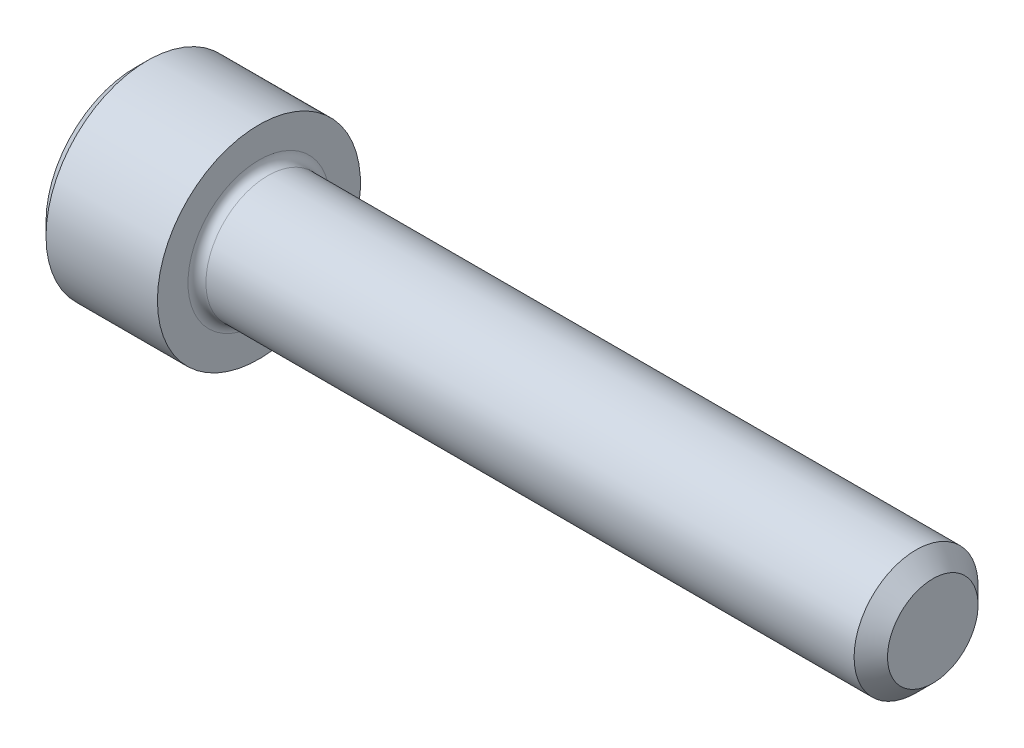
ISO-10303-21;
HEADER;
FILE_DESCRIPTION(('STEP AP214'),'2;1');
FILE_NAME('part.step','',(''),(''),'','','');
FILE_SCHEMA(('AUTOMOTIVE_DESIGN { 1 0 10303 214 1 1 1 1 }'));
ENDSEC;
DATA;
#1=APPLICATION_CONTEXT('core data for automotive mechanical design processes');
#2=APPLICATION_PROTOCOL_DEFINITION('international standard','automotive_design',2000,#1);
#3=PRODUCT_CONTEXT('',#1,'mechanical');
#4=PRODUCT('Part','Part','',(#3));
#5=PRODUCT_RELATED_PRODUCT_CATEGORY('part','',(#4));
#6=PRODUCT_DEFINITION_FORMATION('','',#4);
#7=PRODUCT_DEFINITION_CONTEXT('part definition',#1,'design');
#8=PRODUCT_DEFINITION('design','',#6,#7);
#9=PRODUCT_DEFINITION_SHAPE('','',#8);
#10=(LENGTH_UNIT() NAMED_UNIT(*) SI_UNIT(.MILLI.,.METRE.));
#11=(NAMED_UNIT(*) PLANE_ANGLE_UNIT() SI_UNIT($,.RADIAN.));
#12=(NAMED_UNIT(*) SI_UNIT($,.STERADIAN.) SOLID_ANGLE_UNIT());
#13=UNCERTAINTY_MEASURE_WITH_UNIT(LENGTH_MEASURE(1.E-05),#10,'distance_accuracy_value','');
#14=(GEOMETRIC_REPRESENTATION_CONTEXT(3) GLOBAL_UNCERTAINTY_ASSIGNED_CONTEXT((#13)) GLOBAL_UNIT_ASSIGNED_CONTEXT((#10,
#11,#12)) REPRESENTATION_CONTEXT('',''));
#15=CARTESIAN_POINT('',(0.,0.,0.));
#16=DIRECTION('',(0.,0.,1.));
#17=DIRECTION('',(1.,0.,0.));
#18=AXIS2_PLACEMENT_3D('',#15,#16,#17);
#19=CARTESIAN_POINT('',(0.,0.,0.));
#20=DIRECTION('',(-1.,0.,0.));
#21=DIRECTION('',(0.,0.,0.999999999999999));
#22=AXIS2_PLACEMENT_3D('',#19,#20,#21);
#23=PLANE('',#22);
#24=DIRECTION('',(0.,-0.499999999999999,0.866025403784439));
#25=VECTOR('',#24,1.);
#26=CARTESIAN_POINT('',(0.,1.59845195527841,0.));
#27=LINE('',#26,#25);
#28=CARTESIAN_POINT('',(0.,1.59845195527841,0.));
#29=VERTEX_POINT('',#28);
#30=CARTESIAN_POINT('',(0.,0.799225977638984,1.38430000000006));
#31=VERTEX_POINT('',#30);
#32=EDGE_CURVE('E118',#29,#31,#27,.T.);
#33=ORIENTED_EDGE('',*,*,#32,.T.);
#34=DIRECTION('',(0.,0.999999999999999,0.));
#35=VECTOR('',#34,1.);
#36=CARTESIAN_POINT('',(0.,-0.79922597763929,1.38430000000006));
#37=LINE('',#36,#35);
#38=CARTESIAN_POINT('',(0.,-0.79922597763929,1.38430000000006));
#39=VERTEX_POINT('',#38);
#40=EDGE_CURVE('E107',#39,#31,#37,.T.);
#41=ORIENTED_EDGE('',*,*,#40,.F.);
#42=DIRECTION('',(0.,-0.500000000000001,-0.866025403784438));
#43=VECTOR('',#42,1.);
#44=CARTESIAN_POINT('',(0.,-0.79922597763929,1.38430000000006));
#45=LINE('',#44,#43);
#46=CARTESIAN_POINT('',(0.,-1.59845195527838,0.));
#47=VERTEX_POINT('',#46);
#48=EDGE_CURVE('E117',#39,#47,#45,.T.);
#49=ORIENTED_EDGE('',*,*,#48,.T.);
#50=DIRECTION('',(0.,0.499999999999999,-0.866025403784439));
#51=VECTOR('',#50,1.);
#52=CARTESIAN_POINT('',(0.,-1.59845195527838,0.));
#53=LINE('',#52,#51);
#54=CARTESIAN_POINT('',(0.,-0.799225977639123,-1.38429999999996));
#55=VERTEX_POINT('',#54);
#56=EDGE_CURVE('E136',#47,#55,#53,.T.);
#57=ORIENTED_EDGE('',*,*,#56,.T.);
#58=DIRECTION('',(0.,-1.,0.));
#59=VECTOR('',#58,1.);
#60=CARTESIAN_POINT('',(0.,0.799225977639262,-1.38430000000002));
#61=LINE('',#60,#59);
#62=CARTESIAN_POINT('',(0.,0.799225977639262,-1.38430000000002));
#63=VERTEX_POINT('',#62);
#64=EDGE_CURVE('E139',#63,#55,#61,.T.);
#65=ORIENTED_EDGE('',*,*,#64,.F.);
#66=DIRECTION('',(0.,-0.500000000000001,-0.866025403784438));
#67=VECTOR('',#66,1.);
#68=CARTESIAN_POINT('',(0.,1.59845195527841,0.));
#69=LINE('',#68,#67);
#70=EDGE_CURVE('E132',#29,#63,#69,.T.);
#71=ORIENTED_EDGE('',*,*,#70,.F.);
#72=EDGE_LOOP('',(#33,#41,#49,#57,#65,#71));
#73=FACE_BOUND('',#72,.T.);
#74=CARTESIAN_POINT('',(0.,0.,0.));
#75=DIRECTION('',(-1.,0.,0.));
#76=DIRECTION('',(0.,0.,0.999999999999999));
#77=AXIS2_PLACEMENT_3D('',#74,#75,#76);
#78=CIRCLE('',#77,2.51459999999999);
#79=CARTESIAN_POINT('',(0.,0.,2.51459999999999));
#80=VERTEX_POINT('',#79);
#81=EDGE_CURVE('E190',#80,#80,#78,.T.);
#82=ORIENTED_EDGE('',*,*,#81,.T.);
#83=EDGE_LOOP('',(#82));
#84=FACE_BOUND('',#83,.T.);
#85=ADVANCED_FACE('F36',(#73,#84),#23,.T.);
#86=CARTESIAN_POINT('',(0.,0.,0.));
#87=DIRECTION('',(1.,0.,0.));
#88=DIRECTION('',(0.,0.,-0.999999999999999));
#89=AXIS2_PLACEMENT_3D('',#86,#87,#88);
#90=CONICAL_SURFACE('',#89,2.51459999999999,0.785398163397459);
#91=CARTESIAN_POINT('',(0.355600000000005,0.,0.));
#92=DIRECTION('',(-1.,0.,0.));
#93=DIRECTION('',(0.,0.,0.999999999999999));
#94=AXIS2_PLACEMENT_3D('',#91,#92,#93);
#95=CIRCLE('',#94,2.8702);
#96=CARTESIAN_POINT('',(0.355600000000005,0.,2.8702));
#97=VERTEX_POINT('',#96);
#98=EDGE_CURVE('E187',#97,#97,#95,.T.);
#99=ORIENTED_EDGE('',*,*,#98,.T.);
#100=EDGE_LOOP('',(#99));
#101=FACE_BOUND('',#100,.T.);
#102=ORIENTED_EDGE('',*,*,#81,.F.);
#103=EDGE_LOOP('',(#102));
#104=FACE_BOUND('',#103,.T.);
#105=ADVANCED_FACE('F214',(#101,#104),#90,.T.);
#106=CARTESIAN_POINT('',(-31.7499999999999,0.,0.));
#107=DIRECTION('',(-1.,0.,0.));
#108=DIRECTION('',(0.,0.,0.999999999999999));
#109=AXIS2_PLACEMENT_3D('',#106,#107,#108);
#110=CYLINDRICAL_SURFACE('',#109,2.8702);
#111=CARTESIAN_POINT('',(3.50520000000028,0.,0.));
#112=DIRECTION('',(-1.,0.,0.));
#113=DIRECTION('',(0.,0.,0.999999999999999));
#114=AXIS2_PLACEMENT_3D('',#111,#112,#113);
#115=CIRCLE('',#114,2.8702);
#116=CARTESIAN_POINT('',(3.50520000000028,0.,2.8702));
#117=VERTEX_POINT('',#116);
#118=EDGE_CURVE('E184',#117,#117,#115,.T.);
#119=ORIENTED_EDGE('',*,*,#118,.T.);
#120=EDGE_LOOP('',(#119));
#121=FACE_BOUND('',#120,.T.);
#122=ORIENTED_EDGE('',*,*,#98,.F.);
#123=EDGE_LOOP('',(#122));
#124=FACE_BOUND('',#123,.T.);
#125=ADVANCED_FACE('F218',(#121,#124),#110,.T.);
#126=CARTESIAN_POINT('',(3.50520000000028,2.87019999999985,0.));
#127=DIRECTION('',(1.,0.,0.));
#128=DIRECTION('',(0.,0.,-0.999999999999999));
#129=AXIS2_PLACEMENT_3D('',#126,#127,#128);
#130=PLANE('',#129);
#131=CARTESIAN_POINT('',(3.50520000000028,0.,0.));
#132=DIRECTION('',(1.,0.,0.));
#133=DIRECTION('',(0.,0.,-0.999999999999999));
#134=AXIS2_PLACEMENT_3D('',#131,#132,#133);
#135=CIRCLE('',#134,2.00659999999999);
#136=CARTESIAN_POINT('',(3.50520000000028,0.,-2.00659999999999));
#137=VERTEX_POINT('',#136);
#138=EDGE_CURVE('E43',#137,#137,#135,.F.);
#139=ORIENTED_EDGE('',*,*,#138,.T.);
#140=EDGE_LOOP('',(#139));
#141=FACE_BOUND('',#140,.T.);
#142=ORIENTED_EDGE('',*,*,#118,.F.);
#143=EDGE_LOOP('',(#142));
#144=FACE_BOUND('',#143,.T.);
#145=ADVANCED_FACE('F195',(#141,#144),#130,.T.);
#146=CARTESIAN_POINT('',(-31.7499999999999,0.,0.));
#147=DIRECTION('',(-1.,0.,0.));
#148=DIRECTION('',(0.,0.,0.999999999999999));
#149=AXIS2_PLACEMENT_3D('',#146,#147,#148);
#150=CYLINDRICAL_SURFACE('',#149,1.75259999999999);
#151=CARTESIAN_POINT('',(3.75920000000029,0.,0.));
#152=DIRECTION('',(1.,0.,0.));
#153=DIRECTION('',(0.,0.,-0.999999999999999));
#154=AXIS2_PLACEMENT_3D('',#151,#152,#153);
#155=CIRCLE('',#154,1.75259999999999);
#156=CARTESIAN_POINT('',(3.75920000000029,0.,-1.75259999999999));
#157=VERTEX_POINT('',#156);
#158=EDGE_CURVE('E11',#157,#157,#155,.T.);
#159=ORIENTED_EDGE('',*,*,#158,.T.);
#160=EDGE_LOOP('',(#159));
#161=FACE_BOUND('',#160,.T.);
#162=CARTESIAN_POINT('',(22.08276,0.,0.));
#163=DIRECTION('',(-1.,0.,0.));
#164=DIRECTION('',(0.,0.,0.999999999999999));
#165=AXIS2_PLACEMENT_3D('',#162,#163,#164);
#166=CIRCLE('',#165,1.75259999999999);
#167=CARTESIAN_POINT('',(22.08276,0.,1.75259999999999));
#168=VERTEX_POINT('',#167);
#169=EDGE_CURVE('E181',#168,#168,#166,.T.);
#170=ORIENTED_EDGE('',*,*,#169,.T.);
#171=EDGE_LOOP('',(#170));
#172=FACE_BOUND('',#171,.T.);
#173=ADVANCED_FACE('F229',(#161,#172),#150,.T.);
#174=CARTESIAN_POINT('',(22.5552,0.,0.));
#175=DIRECTION('',(-1.,0.,0.));
#176=DIRECTION('',(0.,0.,0.999999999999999));
#177=AXIS2_PLACEMENT_3D('',#174,#175,#176);
#178=CONICAL_SURFACE('',#177,1.28016,0.78539816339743);
#179=ORIENTED_EDGE('',*,*,#169,.F.);
#180=EDGE_LOOP('',(#179));
#181=FACE_BOUND('',#180,.T.);
#182=CARTESIAN_POINT('',(22.5552,0.,0.));
#183=DIRECTION('',(-1.,0.,0.));
#184=DIRECTION('',(0.,0.,0.999999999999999));
#185=AXIS2_PLACEMENT_3D('',#182,#183,#184);
#186=CIRCLE('',#185,1.28016);
#187=CARTESIAN_POINT('',(22.5552,0.,1.28016));
#188=VERTEX_POINT('',#187);
#189=EDGE_CURVE('E177',#188,#188,#186,.T.);
#190=ORIENTED_EDGE('',*,*,#189,.T.);
#191=EDGE_LOOP('',(#190));
#192=FACE_BOUND('',#191,.T.);
#193=ADVANCED_FACE('F208',(#181,#192),#178,.T.);
#194=CARTESIAN_POINT('',(22.5552,1.28016000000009,0.));
#195=DIRECTION('',(1.,0.,0.));
#196=DIRECTION('',(0.,0.,-0.999999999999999));
#197=AXIS2_PLACEMENT_3D('',#194,#195,#196);
#198=PLANE('',#197);
#199=ORIENTED_EDGE('',*,*,#189,.F.);
#200=EDGE_LOOP('',(#199));
#201=FACE_BOUND('',#200,.T.);
#202=ADVANCED_FACE('F200',(#201),#198,.T.);
#203=CARTESIAN_POINT('',(3.75920000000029,0.,0.));
#204=DIRECTION('',(1.,0.,0.));
#205=DIRECTION('',(0.,0.,-0.999999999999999));
#206=AXIS2_PLACEMENT_3D('',#203,#204,#205);
#207=TOROIDAL_SURFACE('',#206,2.00659999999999,0.254);
#208=ORIENTED_EDGE('',*,*,#158,.F.);
#209=EDGE_LOOP('',(#208));
#210=FACE_BOUND('',#209,.T.);
#211=ORIENTED_EDGE('',*,*,#138,.F.);
#212=EDGE_LOOP('',(#211));
#213=FACE_BOUND('',#212,.T.);
#214=ADVANCED_FACE('F198',(#210,#213),#207,.F.);
#215=CARTESIAN_POINT('',(1.62560000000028,1.59845195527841,0.));
#216=DIRECTION('',(0.,-0.866025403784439,-0.499999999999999));
#217=DIRECTION('',(0.,0.499999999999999,-0.866025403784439));
#218=AXIS2_PLACEMENT_3D('',#215,#216,#217);
#219=PLANE('',#218);
#220=ORIENTED_EDGE('',*,*,#32,.F.);
#221=DIRECTION('',(-1.,0.,0.));
#222=VECTOR('',#221,1.);
#223=CARTESIAN_POINT('',(1.62560000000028,1.59845195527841,0.));
#224=LINE('',#223,#222);
#225=CARTESIAN_POINT('',(1.62560000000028,1.59845195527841,0.));
#226=VERTEX_POINT('',#225);
#227=EDGE_CURVE('E162',#226,#29,#224,.T.);
#228=ORIENTED_EDGE('',*,*,#227,.F.);
#229=DIRECTION('',(0.,-0.499999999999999,0.866025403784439));
#230=VECTOR('',#229,1.);
#231=CARTESIAN_POINT('',(1.62560000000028,1.59845195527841,0.));
#232=LINE('',#231,#230);
#233=CARTESIAN_POINT('',(1.62560000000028,1.19883896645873,0.69215000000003));
#234=VERTEX_POINT('',#233);
#235=EDGE_CURVE('E142',#226,#234,#232,.T.);
#236=ORIENTED_EDGE('',*,*,#235,.T.);
#237=CARTESIAN_POINT('',(1.62560000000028,0.799225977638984,1.38430000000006));
#238=VERTEX_POINT('',#237);
#239=EDGE_CURVE('E126',#234,#238,#232,.T.);
#240=ORIENTED_EDGE('',*,*,#239,.T.);
#241=DIRECTION('',(-1.,0.,0.));
#242=VECTOR('',#241,1.);
#243=CARTESIAN_POINT('',(1.62560000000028,0.799225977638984,1.38430000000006));
#244=LINE('',#243,#242);
#245=EDGE_CURVE('E111',#238,#31,#244,.T.);
#246=ORIENTED_EDGE('',*,*,#245,.T.);
#247=EDGE_LOOP('',(#220,#228,#236,#240,#246));
#248=FACE_BOUND('',#247,.T.);
#249=ADVANCED_FACE('F122',(#248),#219,.T.);
#250=CARTESIAN_POINT('',(1.62560000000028,-0.79922597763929,1.38430000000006));
#251=DIRECTION('',(0.,0.,0.999999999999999));
#252=DIRECTION('',(0.,-0.999999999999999,0.));
#253=AXIS2_PLACEMENT_3D('',#250,#251,#252);
#254=PLANE('',#253);
#255=ORIENTED_EDGE('',*,*,#40,.T.);
#256=ORIENTED_EDGE('',*,*,#245,.F.);
#257=DIRECTION('',(0.,0.999999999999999,0.));
#258=VECTOR('',#257,1.);
#259=CARTESIAN_POINT('',(1.62560000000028,-0.79922597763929,1.38430000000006));
#260=LINE('',#259,#258);
#261=CARTESIAN_POINT('',(1.62560000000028,0.,1.38430000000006));
#262=VERTEX_POINT('',#261);
#263=EDGE_CURVE('E144',#262,#238,#260,.T.);
#264=ORIENTED_EDGE('',*,*,#263,.F.);
#265=CARTESIAN_POINT('',(1.62560000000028,-0.79922597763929,1.38430000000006));
#266=VERTEX_POINT('',#265);
#267=EDGE_CURVE('E145',#266,#262,#260,.T.);
#268=ORIENTED_EDGE('',*,*,#267,.F.);
#269=DIRECTION('',(-1.,0.,0.));
#270=VECTOR('',#269,1.);
#271=CARTESIAN_POINT('',(1.62560000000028,-0.79922597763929,1.38430000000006));
#272=LINE('',#271,#270);
#273=EDGE_CURVE('E113',#266,#39,#272,.T.);
#274=ORIENTED_EDGE('',*,*,#273,.T.);
#275=EDGE_LOOP('',(#255,#256,#264,#268,#274));
#276=FACE_BOUND('',#275,.T.);
#277=ADVANCED_FACE('F109',(#276),#254,.F.);
#278=CARTESIAN_POINT('',(1.62560000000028,-0.79922597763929,1.38430000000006));
#279=DIRECTION('',(0.,0.866025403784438,-0.500000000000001));
#280=DIRECTION('',(0.,0.500000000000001,0.866025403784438));
#281=AXIS2_PLACEMENT_3D('',#278,#279,#280);
#282=PLANE('',#281);
#283=ORIENTED_EDGE('',*,*,#48,.F.);
#284=ORIENTED_EDGE('',*,*,#273,.F.);
#285=DIRECTION('',(0.,-0.500000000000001,-0.866025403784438));
#286=VECTOR('',#285,1.);
#287=CARTESIAN_POINT('',(1.62560000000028,-0.79922597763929,1.38430000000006));
#288=LINE('',#287,#286);
#289=CARTESIAN_POINT('',(1.62560000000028,-1.19883896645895,0.692150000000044));
#290=VERTEX_POINT('',#289);
#291=EDGE_CURVE('E149',#266,#290,#288,.T.);
#292=ORIENTED_EDGE('',*,*,#291,.T.);
#293=CARTESIAN_POINT('',(1.62560000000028,-1.59845195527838,0.));
#294=VERTEX_POINT('',#293);
#295=EDGE_CURVE('E148',#290,#294,#288,.T.);
#296=ORIENTED_EDGE('',*,*,#295,.T.);
#297=DIRECTION('',(-1.,0.,0.));
#298=VECTOR('',#297,1.);
#299=CARTESIAN_POINT('',(1.62560000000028,-1.59845195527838,0.));
#300=LINE('',#299,#298);
#301=EDGE_CURVE('E170',#294,#47,#300,.T.);
#302=ORIENTED_EDGE('',*,*,#301,.T.);
#303=EDGE_LOOP('',(#283,#284,#292,#296,#302));
#304=FACE_BOUND('',#303,.T.);
#305=ADVANCED_FACE('F270',(#304),#282,.T.);
#306=CARTESIAN_POINT('',(1.62560000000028,-1.59845195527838,0.));
#307=DIRECTION('',(0.,0.866025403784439,0.499999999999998));
#308=DIRECTION('',(0.,-0.499999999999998,0.866025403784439));
#309=AXIS2_PLACEMENT_3D('',#306,#307,#308);
#310=PLANE('',#309);
#311=ORIENTED_EDGE('',*,*,#56,.F.);
#312=ORIENTED_EDGE('',*,*,#301,.F.);
#313=DIRECTION('',(0.,0.499999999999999,-0.866025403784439));
#314=VECTOR('',#313,1.);
#315=CARTESIAN_POINT('',(1.62560000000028,-1.59845195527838,0.));
#316=LINE('',#315,#314);
#317=CARTESIAN_POINT('',(1.62560000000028,-1.19883896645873,-0.692150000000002));
#318=VERTEX_POINT('',#317);
#319=EDGE_CURVE('E153',#294,#318,#316,.T.);
#320=ORIENTED_EDGE('',*,*,#319,.T.);
#321=CARTESIAN_POINT('',(1.62560000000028,-0.799225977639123,-1.38429999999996));
#322=VERTEX_POINT('',#321);
#323=EDGE_CURVE('E152',#318,#322,#316,.T.);
#324=ORIENTED_EDGE('',*,*,#323,.T.);
#325=DIRECTION('',(-1.,0.,0.));
#326=VECTOR('',#325,1.);
#327=CARTESIAN_POINT('',(1.62560000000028,-0.799225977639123,-1.38429999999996));
#328=LINE('',#327,#326);
#329=EDGE_CURVE('E167',#322,#55,#328,.T.);
#330=ORIENTED_EDGE('',*,*,#329,.T.);
#331=EDGE_LOOP('',(#311,#312,#320,#324,#330));
#332=FACE_BOUND('',#331,.T.);
#333=ADVANCED_FACE('F277',(#332),#310,.T.);
#334=CARTESIAN_POINT('',(1.62560000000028,0.799225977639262,-1.38430000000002));
#335=DIRECTION('',(0.,0.,-1.));
#336=DIRECTION('',(0.,1.,0.));
#337=AXIS2_PLACEMENT_3D('',#334,#335,#336);
#338=PLANE('',#337);
#339=ORIENTED_EDGE('',*,*,#64,.T.);
#340=ORIENTED_EDGE('',*,*,#329,.F.);
#341=DIRECTION('',(0.,-1.,0.));
#342=VECTOR('',#341,1.);
#343=CARTESIAN_POINT('',(1.62560000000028,0.799225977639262,-1.38430000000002));
#344=LINE('',#343,#342);
#345=CARTESIAN_POINT('',(1.62560000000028,0.,-1.3843));
#346=VERTEX_POINT('',#345);
#347=EDGE_CURVE('E156',#346,#322,#344,.T.);
#348=ORIENTED_EDGE('',*,*,#347,.F.);
#349=CARTESIAN_POINT('',(1.62560000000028,0.799225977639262,-1.38430000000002));
#350=VERTEX_POINT('',#349);
#351=EDGE_CURVE('E50',#350,#346,#344,.T.);
#352=ORIENTED_EDGE('',*,*,#351,.F.);
#353=DIRECTION('',(-1.,0.,0.));
#354=VECTOR('',#353,1.);
#355=CARTESIAN_POINT('',(1.62560000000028,0.799225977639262,-1.38430000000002));
#356=LINE('',#355,#354);
#357=EDGE_CURVE('E164',#350,#63,#356,.T.);
#358=ORIENTED_EDGE('',*,*,#357,.T.);
#359=EDGE_LOOP('',(#339,#340,#348,#352,#358));
#360=FACE_BOUND('',#359,.T.);
#361=ADVANCED_FACE('F285',(#360),#338,.F.);
#362=CARTESIAN_POINT('',(1.62560000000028,1.59845195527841,0.));
#363=DIRECTION('',(0.,0.866025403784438,-0.500000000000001));
#364=DIRECTION('',(0.,0.500000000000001,0.866025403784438));
#365=AXIS2_PLACEMENT_3D('',#362,#363,#364);
#366=PLANE('',#365);
#367=ORIENTED_EDGE('',*,*,#70,.T.);
#368=ORIENTED_EDGE('',*,*,#357,.F.);
#369=DIRECTION('',(0.,-0.500000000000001,-0.866025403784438));
#370=VECTOR('',#369,1.);
#371=CARTESIAN_POINT('',(1.62560000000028,1.59845195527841,0.));
#372=LINE('',#371,#370);
#373=CARTESIAN_POINT('',(1.62560000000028,1.19883896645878,-0.692150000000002));
#374=VERTEX_POINT('',#373);
#375=EDGE_CURVE('E158',#374,#350,#372,.T.);
#376=ORIENTED_EDGE('',*,*,#375,.F.);
#377=EDGE_CURVE('E159',#226,#374,#372,.T.);
#378=ORIENTED_EDGE('',*,*,#377,.F.);
#379=ORIENTED_EDGE('',*,*,#227,.T.);
#380=EDGE_LOOP('',(#367,#368,#376,#378,#379));
#381=FACE_BOUND('',#380,.T.);
#382=ADVANCED_FACE('F293',(#381),#366,.F.);
#383=CARTESIAN_POINT('',(1.62560000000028,0.,2.76860000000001));
#384=DIRECTION('',(1.,0.,0.));
#385=DIRECTION('',(0.,0.,-0.999999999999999));
#386=AXIS2_PLACEMENT_3D('',#383,#384,#385);
#387=PLANE('',#386);
#388=ORIENTED_EDGE('',*,*,#347,.T.);
#389=ORIENTED_EDGE('',*,*,#323,.F.);
#390=CARTESIAN_POINT('',(1.62560000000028,0.,0.));
#391=DIRECTION('',(-1.,0.,0.));
#392=DIRECTION('',(0.,0.,0.999999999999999));
#393=AXIS2_PLACEMENT_3D('',#390,#391,#392);
#394=CIRCLE('',#393,1.3843);
#395=EDGE_CURVE('E353',#346,#318,#394,.T.);
#396=ORIENTED_EDGE('',*,*,#395,.F.);
#397=EDGE_LOOP('',(#388,#389,#396));
#398=FACE_BOUND('',#397,.T.);
#399=ADVANCED_FACE('F301',(#398),#387,.F.);
#400=ORIENTED_EDGE('',*,*,#319,.F.);
#401=ORIENTED_EDGE('',*,*,#295,.F.);
#402=EDGE_CURVE('E356',#318,#290,#394,.T.);
#403=ORIENTED_EDGE('',*,*,#402,.F.);
#404=EDGE_LOOP('',(#400,#401,#403));
#405=FACE_BOUND('',#404,.T.);
#406=ADVANCED_FACE('F309',(#405),#387,.F.);
#407=ORIENTED_EDGE('',*,*,#291,.F.);
#408=ORIENTED_EDGE('',*,*,#267,.T.);
#409=EDGE_CURVE('E127',#290,#262,#394,.T.);
#410=ORIENTED_EDGE('',*,*,#409,.F.);
#411=EDGE_LOOP('',(#407,#408,#410));
#412=FACE_BOUND('',#411,.T.);
#413=ADVANCED_FACE('F317',(#412),#387,.F.);
#414=ORIENTED_EDGE('',*,*,#263,.T.);
#415=ORIENTED_EDGE('',*,*,#239,.F.);
#416=EDGE_CURVE('E174',#262,#234,#394,.T.);
#417=ORIENTED_EDGE('',*,*,#416,.F.);
#418=EDGE_LOOP('',(#414,#415,#417));
#419=FACE_BOUND('',#418,.T.);
#420=ADVANCED_FACE('F324',(#419),#387,.F.);
#421=ORIENTED_EDGE('',*,*,#235,.F.);
#422=ORIENTED_EDGE('',*,*,#377,.T.);
#423=EDGE_CURVE('E178',#234,#374,#394,.T.);
#424=ORIENTED_EDGE('',*,*,#423,.F.);
#425=EDGE_LOOP('',(#421,#422,#424));
#426=FACE_BOUND('',#425,.T.);
#427=ADVANCED_FACE('F331',(#426),#387,.F.);
#428=ORIENTED_EDGE('',*,*,#375,.T.);
#429=ORIENTED_EDGE('',*,*,#351,.T.);
#430=EDGE_CURVE('E346',#374,#346,#394,.T.);
#431=ORIENTED_EDGE('',*,*,#430,.F.);
#432=EDGE_LOOP('',(#428,#429,#431));
#433=FACE_BOUND('',#432,.T.);
#434=ADVANCED_FACE('F256',(#433),#387,.F.);
#435=CARTESIAN_POINT('',(1.62560000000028,0.,0.));
#436=DIRECTION('',(-1.,0.,0.));
#437=DIRECTION('',(0.,0.,0.999999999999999));
#438=AXIS2_PLACEMENT_3D('',#435,#436,#437);
#439=CONICAL_SURFACE('',#438,1.3843,1.04719755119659);
#440=CARTESIAN_POINT('',(2.42482597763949,0.,0.));
#441=VERTEX_POINT('',#440);
#442=VERTEX_LOOP('',#441);
#443=FACE_BOUND('',#442,.T.);
#444=ORIENTED_EDGE('',*,*,#416,.T.);
#445=ORIENTED_EDGE('',*,*,#423,.T.);
#446=ORIENTED_EDGE('',*,*,#430,.T.);
#447=ORIENTED_EDGE('',*,*,#395,.T.);
#448=ORIENTED_EDGE('',*,*,#402,.T.);
#449=ORIENTED_EDGE('',*,*,#409,.T.);
#450=EDGE_LOOP('',(#444,#445,#446,#447,#448,#449));
#451=FACE_BOUND('',#450,.T.);
#452=ADVANCED_FACE('F252',(#443,#451),#439,.F.);
#453=CLOSED_SHELL('',(#85,#105,#125,#145,#173,#193,#202,#214,#249,#277,#305,#333,#361,#382,#399,
#406,#413,#420,#427,#434,#452));
#454=MANIFOLD_SOLID_BREP('B2',#453);
#455=ADVANCED_BREP_SHAPE_REPRESENTATION('',(#18,#454),#14);
#456=SHAPE_DEFINITION_REPRESENTATION(#9,#455);
ENDSEC;
END-ISO-10303-21;
